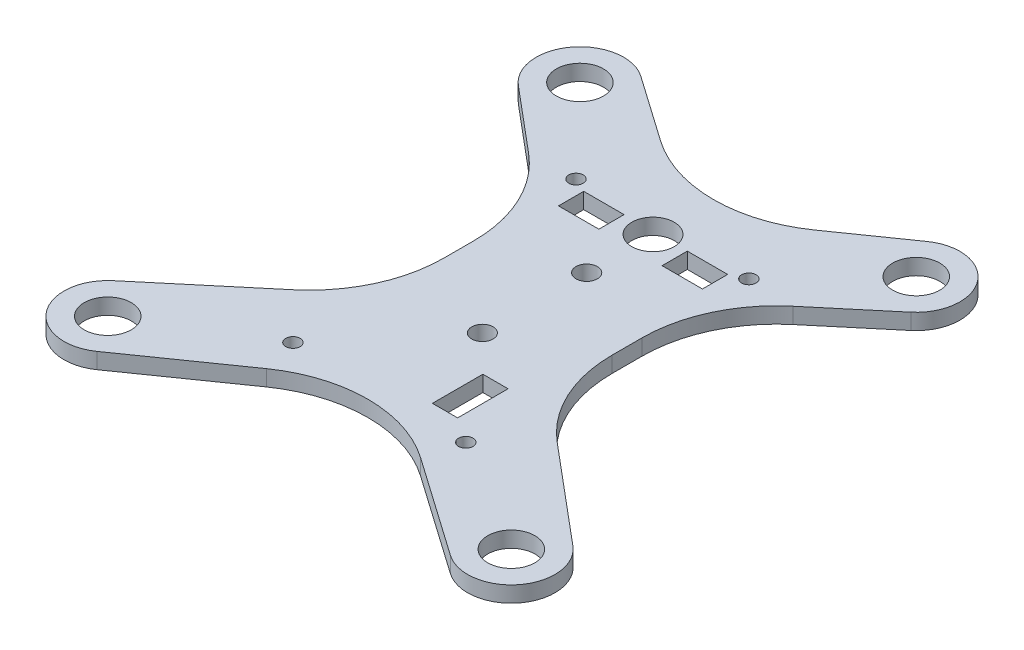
from build123d import *

# Parameters (mm, degrees)
SKETCH1_R                = 1.579261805
SKETCH1_R_2              = 1.5875
BOSS_EXTRUDE1_DEPTH      = 2.3622
F_7_0_7_DIAMETER_HOLE1_D = 7
FILLET1_R                = 20
SKETCH7_W                = 6
SKETCH7_H                = 3.75
SKETCH7_R                = 3.15
SKETCH7_R_2              = 1.075
SKETCH7_W_2              = 3.75
SKETCH7_H_2              = 7.5
CUT_EXTRUDE1_DEPTH       = 56.31798974


with BuildPart() as part:
    # Sketch1 → Boss-Extrude1 (new body)
    with BuildSketch(Plane(origin=(0, 0, 0), x_dir=(1, 0, 0), z_dir=(0, 1, 0))):
        with BuildLine():
            Line((12.5, 16.02610723), (12.5, -7.030609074))
            Line((12.5, -7.030609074), (34.178119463, -25.22071112))
            ThreePointArc((34.178119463, -25.22071112), (35.156796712, -34.156949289), (26.271753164, -35.524488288))
            Line((26.271753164, -35.524488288), (0, -17.128808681))
            Line((0, -17.128808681), (-26.271753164, -35.524488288))
            ThreePointArc((-26.271753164, -35.524488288), (-35.156796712, -34.156949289), (-34.178119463, -25.22071112))
            Line((-34.178119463, -25.22071112), (-12.5, -7.030609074))
            Line((-12.5, -7.030609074), (-12.5, 16.02610723))
            Line((-12.5, 16.02610723), (-29.178119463, 30.02071112))
            ThreePointArc((-29.178119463, 30.02071112), (-30.156796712, 38.956949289), (-21.271753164, 40.324488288))
            Line((-21.271753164, 40.324488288), (0, 25.429846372))
            Line((0, 25.429846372), (21.271753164, 40.324488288))
            ThreePointArc((21.271753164, 40.324488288), (30.156796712, 38.956949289), (29.178119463, 30.02071112))
            Line((29.178119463, 30.02071112), (12.5, 16.02610723))
        make_face()
        with Locations(Location((0, -4.5, 0), (0, 0, 270))):
            Circle(SKETCH1_R, mode=Mode.SUBTRACT)
        with Locations(Location((0, 11, 0), (0, 0, 270))):
            Circle(SKETCH1_R_2, mode=Mode.SUBTRACT)
    extrude(amount=-BOSS_EXTRUDE1_DEPTH)

    # 7.0 _7_ Diameter Hole1 (through all)
    with Locations(Plane(origin=(0, 0, 0), x_dir=(1, 0, 0), z_dir=(0, 1, 0))):
        with Locations((-25, 35), (25, 35), (30, -30.2), (-30, -30.2)):
            Hole(F_7_0_7_DIAMETER_HOLE1_D / 2)

    # Fillet1
    fillet1_edges = [part.edges().sort_by_distance(p)[0] for p in [
        (0, -1.1811, -25.429846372),
        (12.5, -1.1811, -16.02610723),
        (12.5, -1.1811, 7.030609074),
        (0, -1.1811, 17.128808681),
        (-12.5, -1.1811, 7.030609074),
        (-12.5, -1.1811, -16.02610723),
    ]]
    fillet(fillet1_edges, radius=FILLET1_R)

    # Sketch7 → Cut-Extrude1 (cut, through all)
    with BuildSketch(Plane(origin=(0, 0, 0), x_dir=(1, 0, 0), z_dir=(0, 1, 0))):
        with Locations((-7.7, 19.388098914)):
            Rectangle(SKETCH7_W, SKETCH7_H)
        with Locations(Location((0, 20.863098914, 0), (0, 0, 270))):
            Circle(SKETCH7_R)
        with Locations((7.7, 19.388098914)):
            Rectangle(SKETCH7_W, SKETCH7_H)
        with Locations(Location((12.85, 22.263098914, 0), (0, 0, 270))):
            Circle(SKETCH7_R_2)
        with Locations(Location((-12.85, 22.263098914, 0), (0, 0, 270))):
            Circle(SKETCH7_R_2)
        with Locations(Location((-12.85, -19.816901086, 0), (0, 0, 270))):
            Circle(SKETCH7_R_2)
        with Locations(Location((12.85, -19.816901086, 0), (0, 0, 270))):
            Circle(SKETCH7_R_2)
        with Locations((7.225, -13.532640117)):
            Rectangle(SKETCH7_W_2, SKETCH7_H_2)
    extrude(amount=-CUT_EXTRUDE1_DEPTH, mode=Mode.SUBTRACT)


solid = part.part
